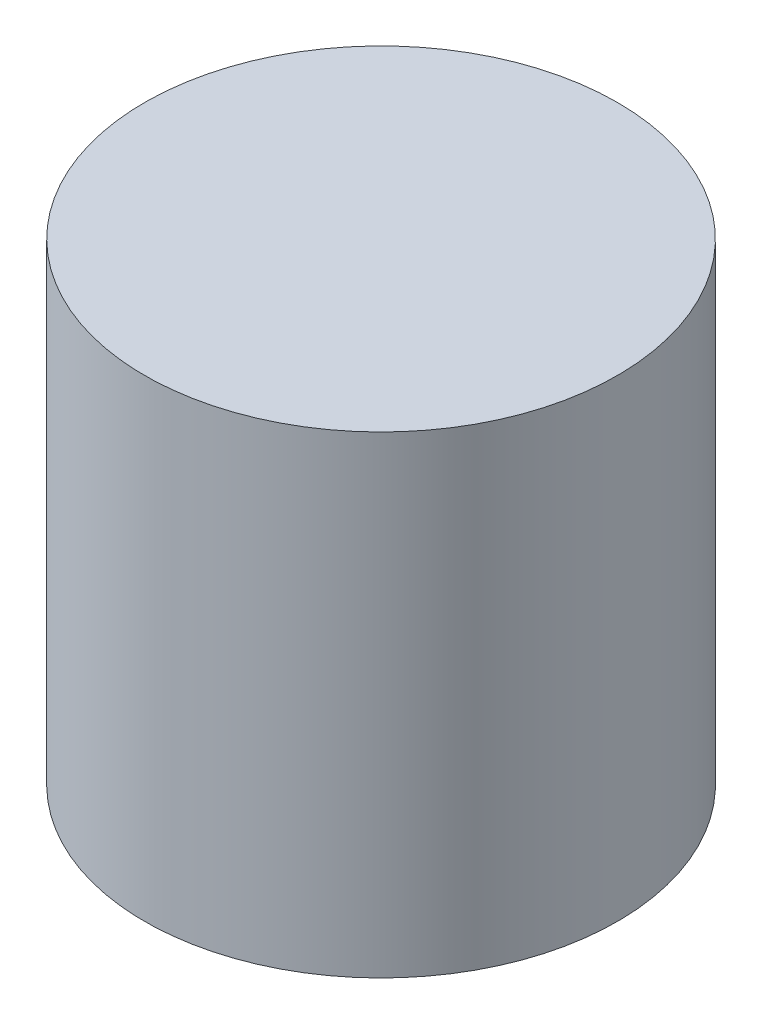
from build123d import *

# Parameters (mm, degrees)
SKETCH1_R           = 38.1
BOSS_EXTRUDE1_DEPTH = 76.2
CIRPATTERN1_COUNT   = 3


with BuildPart() as part:
    # Sketch1 → Boss-Extrude1 (new body)
    with BuildSketch(Plane(origin=(0, 0, 0), x_dir=(1, 0, 0), z_dir=(0, 1, 0))):
        with Locations(Location((0, 0, 0), (0, 0, 90))):
            Circle(SKETCH1_R)
    extrude(amount=BOSS_EXTRUDE1_DEPTH)

    # Sketch2 → 3_8-16 Tapped Hole1 (revolve, cut)
    with BuildSketch(Plane(origin=(0, 0, 25.4), x_dir=(0, 0, -1), z_dir=(1, 0, 0))):
        Polygon((0, 0), (0, 46.197165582), (3.96875, 43.8125), (3.96875, 0), align=None)
    f_3_8_16_tapped_hole1 = revolve(axis=Axis((0, -6.35, 25.4), (0, 1, 0)), mode=Mode.SUBTRACT)

    # CirPattern1: 3_8-16 Tapped Hole1 ×3 about axis
    cirpattern1_axis = Axis((0, 0, 0), (0, 1, 0))
    for i in range(1, CIRPATTERN1_COUNT):
        add(f_3_8_16_tapped_hole1.rotate(cirpattern1_axis, i * 360 / CIRPATTERN1_COUNT), mode=Mode.SUBTRACT)


solid = part.part
